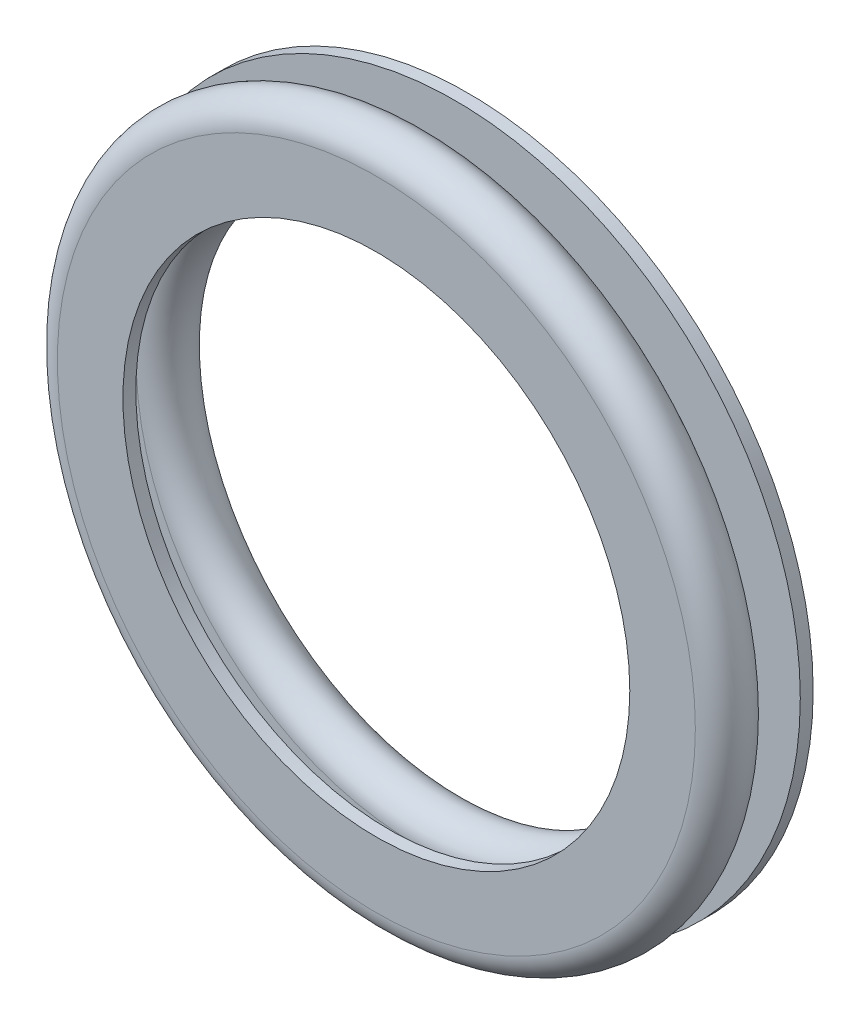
ISO-10303-21;
HEADER;
FILE_DESCRIPTION(('STEP AP214'),'2;1');
FILE_NAME('part.step','',(''),(''),'','','');
FILE_SCHEMA(('AUTOMOTIVE_DESIGN { 1 0 10303 214 1 1 1 1 }'));
ENDSEC;
DATA;
#1=APPLICATION_CONTEXT('core data for automotive mechanical design processes');
#2=APPLICATION_PROTOCOL_DEFINITION('international standard','automotive_design',2000,#1);
#3=PRODUCT_CONTEXT('',#1,'mechanical');
#4=PRODUCT('Part','Part','',(#3));
#5=PRODUCT_RELATED_PRODUCT_CATEGORY('part','',(#4));
#6=PRODUCT_DEFINITION_FORMATION('','',#4);
#7=PRODUCT_DEFINITION_CONTEXT('part definition',#1,'design');
#8=PRODUCT_DEFINITION('design','',#6,#7);
#9=PRODUCT_DEFINITION_SHAPE('','',#8);
#10=(LENGTH_UNIT() NAMED_UNIT(*) SI_UNIT(.MILLI.,.METRE.));
#11=(NAMED_UNIT(*) PLANE_ANGLE_UNIT() SI_UNIT($,.RADIAN.));
#12=(NAMED_UNIT(*) SI_UNIT($,.STERADIAN.) SOLID_ANGLE_UNIT());
#13=UNCERTAINTY_MEASURE_WITH_UNIT(LENGTH_MEASURE(1.E-05),#10,'distance_accuracy_value','');
#14=(GEOMETRIC_REPRESENTATION_CONTEXT(3) GLOBAL_UNCERTAINTY_ASSIGNED_CONTEXT((#13)) GLOBAL_UNIT_ASSIGNED_CONTEXT((#10,
#11,#12)) REPRESENTATION_CONTEXT('',''));
#15=CARTESIAN_POINT('',(0.,0.,0.));
#16=DIRECTION('',(0.,0.,1.));
#17=DIRECTION('',(1.,0.,0.));
#18=AXIS2_PLACEMENT_3D('',#15,#16,#17);
#19=CARTESIAN_POINT('',(0.,0.,0.));
#20=DIRECTION('',(0.,0.,1.));
#21=DIRECTION('',(1.,0.,0.));
#22=AXIS2_PLACEMENT_3D('',#19,#20,#21);
#23=CYLINDRICAL_SURFACE('',#22,4.92);
#24=CARTESIAN_POINT('',(0.,0.,-0.25));
#25=DIRECTION('',(0.,0.,1.));
#26=DIRECTION('',(1.,0.,0.));
#27=AXIS2_PLACEMENT_3D('',#24,#25,#26);
#28=CIRCLE('',#27,4.92);
#29=CARTESIAN_POINT('',(4.92,0.,-0.25));
#30=VERTEX_POINT('',#29);
#31=EDGE_CURVE('E54',#30,#30,#28,.T.);
#32=ORIENTED_EDGE('',*,*,#31,.F.);
#33=EDGE_LOOP('',(#32));
#34=FACE_BOUND('',#33,.T.);
#35=CARTESIAN_POINT('',(0.,0.,0.));
#36=DIRECTION('',(0.,0.,1.));
#37=DIRECTION('',(1.,0.,0.));
#38=AXIS2_PLACEMENT_3D('',#35,#36,#37);
#39=CIRCLE('',#38,4.92);
#40=CARTESIAN_POINT('',(4.92,0.,0.));
#41=VERTEX_POINT('',#40);
#42=EDGE_CURVE('E9',#41,#41,#39,.T.);
#43=ORIENTED_EDGE('',*,*,#42,.T.);
#44=EDGE_LOOP('',(#43));
#45=FACE_BOUND('',#44,.T.);
#46=ADVANCED_FACE('F14',(#34,#45),#23,.F.);
#47=CARTESIAN_POINT('',(0.,4.92,0.));
#48=DIRECTION('',(0.,0.,-1.));
#49=DIRECTION('',(-1.,0.,0.));
#50=AXIS2_PLACEMENT_3D('',#47,#48,#49);
#51=PLANE('',#50);
#52=ORIENTED_EDGE('',*,*,#42,.F.);
#53=EDGE_LOOP('',(#52));
#54=FACE_BOUND('',#53,.T.);
#55=CARTESIAN_POINT('',(0.,0.,0.));
#56=DIRECTION('',(0.,0.,1.));
#57=DIRECTION('',(1.,0.,0.));
#58=AXIS2_PLACEMENT_3D('',#55,#56,#57);
#59=CIRCLE('',#58,6.1925);
#60=CARTESIAN_POINT('',(6.1925,0.,0.));
#61=VERTEX_POINT('',#60);
#62=EDGE_CURVE('E20',#61,#61,#59,.T.);
#63=ORIENTED_EDGE('',*,*,#62,.T.);
#64=EDGE_LOOP('',(#63));
#65=FACE_BOUND('',#64,.T.);
#66=ADVANCED_FACE('F61',(#54,#65),#51,.F.);
#67=CARTESIAN_POINT('',(0.,0.,-0.507500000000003));
#68=DIRECTION('',(0.,0.,1.));
#69=DIRECTION('',(1.,0.,0.));
#70=AXIS2_PLACEMENT_3D('',#67,#68,#69);
#71=TOROIDAL_SURFACE('',#70,6.1925,0.507500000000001);
#72=ORIENTED_EDGE('',*,*,#62,.F.);
#73=EDGE_LOOP('',(#72));
#74=FACE_BOUND('',#73,.T.);
#75=CARTESIAN_POINT('',(0.,0.,-1.015));
#76=DIRECTION('',(0.,0.,1.));
#77=DIRECTION('',(1.,0.,0.));
#78=AXIS2_PLACEMENT_3D('',#75,#76,#77);
#79=CIRCLE('',#78,6.1925);
#80=CARTESIAN_POINT('',(6.1925,0.,-1.015));
#81=VERTEX_POINT('',#80);
#82=EDGE_CURVE('E24',#81,#81,#79,.T.);
#83=ORIENTED_EDGE('',*,*,#82,.T.);
#84=EDGE_LOOP('',(#83));
#85=FACE_BOUND('',#84,.T.);
#86=ADVANCED_FACE('F66',(#74,#85),#71,.T.);
#87=CARTESIAN_POINT('',(0.,6.1925,-1.015));
#88=DIRECTION('',(0.,0.,1.));
#89=DIRECTION('',(1.,0.,0.));
#90=AXIS2_PLACEMENT_3D('',#87,#88,#89);
#91=PLANE('',#90);
#92=ORIENTED_EDGE('',*,*,#82,.F.);
#93=EDGE_LOOP('',(#92));
#94=FACE_BOUND('',#93,.T.);
#95=CARTESIAN_POINT('',(0.,0.,-1.015));
#96=DIRECTION('',(0.,0.,1.));
#97=DIRECTION('',(1.,0.,0.));
#98=AXIS2_PLACEMENT_3D('',#95,#96,#97);
#99=CIRCLE('',#98,5.4275);
#100=CARTESIAN_POINT('',(5.4275,0.,-1.015));
#101=VERTEX_POINT('',#100);
#102=EDGE_CURVE('E28',#101,#101,#99,.T.);
#103=ORIENTED_EDGE('',*,*,#102,.T.);
#104=EDGE_LOOP('',(#103));
#105=FACE_BOUND('',#104,.T.);
#106=ADVANCED_FACE('F71',(#94,#105),#91,.F.);
#107=CARTESIAN_POINT('',(0.,0.,-1.2725));
#108=DIRECTION('',(0.,0.,1.));
#109=DIRECTION('',(1.,0.,0.));
#110=AXIS2_PLACEMENT_3D('',#107,#108,#109);
#111=TOROIDAL_SURFACE('',#110,5.4275,0.257499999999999);
#112=ORIENTED_EDGE('',*,*,#102,.F.);
#113=EDGE_LOOP('',(#112));
#114=FACE_BOUND('',#113,.T.);
#115=CARTESIAN_POINT('',(0.,0.,-1.53));
#116=DIRECTION('',(0.,0.,1.));
#117=DIRECTION('',(1.,0.,0.));
#118=AXIS2_PLACEMENT_3D('',#115,#116,#117);
#119=CIRCLE('',#118,5.4275);
#120=CARTESIAN_POINT('',(5.4275,0.,-1.53));
#121=VERTEX_POINT('',#120);
#122=EDGE_CURVE('E33',#121,#121,#119,.T.);
#123=ORIENTED_EDGE('',*,*,#122,.T.);
#124=EDGE_LOOP('',(#123));
#125=FACE_BOUND('',#124,.T.);
#126=ADVANCED_FACE('F77',(#114,#125),#111,.F.);
#127=CARTESIAN_POINT('',(0.,5.4275,-1.53));
#128=DIRECTION('',(0.,0.,-1.));
#129=DIRECTION('',(-1.,0.,0.));
#130=AXIS2_PLACEMENT_3D('',#127,#128,#129);
#131=PLANE('',#130);
#132=ORIENTED_EDGE('',*,*,#122,.F.);
#133=EDGE_LOOP('',(#132));
#134=FACE_BOUND('',#133,.T.);
#135=CARTESIAN_POINT('',(0.,0.,-1.53));
#136=DIRECTION('',(0.,0.,1.));
#137=DIRECTION('',(1.,0.,0.));
#138=AXIS2_PLACEMENT_3D('',#135,#136,#137);
#139=CIRCLE('',#138,6.7);
#140=CARTESIAN_POINT('',(6.7,0.,-1.53));
#141=VERTEX_POINT('',#140);
#142=EDGE_CURVE('E36',#141,#141,#139,.T.);
#143=ORIENTED_EDGE('',*,*,#142,.T.);
#144=EDGE_LOOP('',(#143));
#145=FACE_BOUND('',#144,.T.);
#146=ADVANCED_FACE('F81',(#134,#145),#131,.F.);
#147=CARTESIAN_POINT('',(0.,0.,0.));
#148=DIRECTION('',(0.,0.,1.));
#149=DIRECTION('',(1.,0.,0.));
#150=AXIS2_PLACEMENT_3D('',#147,#148,#149);
#151=CYLINDRICAL_SURFACE('',#150,6.7);
#152=ORIENTED_EDGE('',*,*,#142,.F.);
#153=EDGE_LOOP('',(#152));
#154=FACE_BOUND('',#153,.T.);
#155=CARTESIAN_POINT('',(0.,0.,-1.78));
#156=DIRECTION('',(0.,0.,1.));
#157=DIRECTION('',(1.,0.,0.));
#158=AXIS2_PLACEMENT_3D('',#155,#156,#157);
#159=CIRCLE('',#158,6.7);
#160=CARTESIAN_POINT('',(6.7,0.,-1.78));
#161=VERTEX_POINT('',#160);
#162=EDGE_CURVE('E39',#161,#161,#159,.T.);
#163=ORIENTED_EDGE('',*,*,#162,.T.);
#164=EDGE_LOOP('',(#163));
#165=FACE_BOUND('',#164,.T.);
#166=ADVANCED_FACE('F85',(#154,#165),#151,.T.);
#167=CARTESIAN_POINT('',(0.,5.4275,-1.78));
#168=DIRECTION('',(0.,0.,1.));
#169=DIRECTION('',(1.,0.,0.));
#170=AXIS2_PLACEMENT_3D('',#167,#168,#169);
#171=PLANE('',#170);
#172=ORIENTED_EDGE('',*,*,#162,.F.);
#173=EDGE_LOOP('',(#172));
#174=FACE_BOUND('',#173,.T.);
#175=CARTESIAN_POINT('',(0.,0.,-1.78));
#176=DIRECTION('',(0.,0.,1.));
#177=DIRECTION('',(1.,0.,0.));
#178=AXIS2_PLACEMENT_3D('',#175,#176,#177);
#179=CIRCLE('',#178,5.4275);
#180=CARTESIAN_POINT('',(5.4275,0.,-1.78));
#181=VERTEX_POINT('',#180);
#182=EDGE_CURVE('E42',#181,#181,#179,.T.);
#183=ORIENTED_EDGE('',*,*,#182,.T.);
#184=EDGE_LOOP('',(#183));
#185=FACE_BOUND('',#184,.T.);
#186=ADVANCED_FACE('F89',(#174,#185),#171,.F.);
#187=CARTESIAN_POINT('',(0.,0.,-1.2725));
#188=DIRECTION('',(0.,0.,1.));
#189=DIRECTION('',(1.,0.,0.));
#190=AXIS2_PLACEMENT_3D('',#187,#188,#189);
#191=TOROIDAL_SURFACE('',#190,5.4275,0.507500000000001);
#192=ORIENTED_EDGE('',*,*,#182,.F.);
#193=EDGE_LOOP('',(#192));
#194=FACE_BOUND('',#193,.T.);
#195=CARTESIAN_POINT('',(0.,0.,-0.765000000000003));
#196=DIRECTION('',(0.,0.,1.));
#197=DIRECTION('',(1.,0.,0.));
#198=AXIS2_PLACEMENT_3D('',#195,#196,#197);
#199=CIRCLE('',#198,5.4275);
#200=CARTESIAN_POINT('',(5.4275,0.,-0.765000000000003));
#201=VERTEX_POINT('',#200);
#202=EDGE_CURVE('E45',#201,#201,#199,.T.);
#203=ORIENTED_EDGE('',*,*,#202,.T.);
#204=EDGE_LOOP('',(#203));
#205=FACE_BOUND('',#204,.T.);
#206=ADVANCED_FACE('F93',(#194,#205),#191,.T.);
#207=CARTESIAN_POINT('',(0.,6.1925,-0.765000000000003));
#208=DIRECTION('',(0.,0.,-1.));
#209=DIRECTION('',(-1.,0.,0.));
#210=AXIS2_PLACEMENT_3D('',#207,#208,#209);
#211=PLANE('',#210);
#212=ORIENTED_EDGE('',*,*,#202,.F.);
#213=EDGE_LOOP('',(#212));
#214=FACE_BOUND('',#213,.T.);
#215=CARTESIAN_POINT('',(0.,0.,-0.765000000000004));
#216=DIRECTION('',(0.,0.,1.));
#217=DIRECTION('',(1.,0.,0.));
#218=AXIS2_PLACEMENT_3D('',#215,#216,#217);
#219=CIRCLE('',#218,6.1925);
#220=CARTESIAN_POINT('',(6.1925,0.,-0.765000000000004));
#221=VERTEX_POINT('',#220);
#222=EDGE_CURVE('E48',#221,#221,#219,.T.);
#223=ORIENTED_EDGE('',*,*,#222,.T.);
#224=EDGE_LOOP('',(#223));
#225=FACE_BOUND('',#224,.T.);
#226=ADVANCED_FACE('F97',(#214,#225),#211,.F.);
#227=CARTESIAN_POINT('',(0.,0.,-0.507500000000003));
#228=DIRECTION('',(0.,0.,1.));
#229=DIRECTION('',(1.,0.,0.));
#230=AXIS2_PLACEMENT_3D('',#227,#228,#229);
#231=TOROIDAL_SURFACE('',#230,6.1925,0.257500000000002);
#232=ORIENTED_EDGE('',*,*,#222,.F.);
#233=EDGE_LOOP('',(#232));
#234=FACE_BOUND('',#233,.T.);
#235=CARTESIAN_POINT('',(0.,0.,-0.250000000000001));
#236=DIRECTION('',(0.,0.,1.));
#237=DIRECTION('',(1.,0.,0.));
#238=AXIS2_PLACEMENT_3D('',#235,#236,#237);
#239=CIRCLE('',#238,6.1925);
#240=CARTESIAN_POINT('',(6.1925,0.,-0.250000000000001));
#241=VERTEX_POINT('',#240);
#242=EDGE_CURVE('E51',#241,#241,#239,.T.);
#243=ORIENTED_EDGE('',*,*,#242,.T.);
#244=EDGE_LOOP('',(#243));
#245=FACE_BOUND('',#244,.T.);
#246=ADVANCED_FACE('F101',(#234,#245),#231,.F.);
#247=CARTESIAN_POINT('',(0.,4.92,-0.250000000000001));
#248=DIRECTION('',(0.,0.,1.));
#249=DIRECTION('',(1.,0.,0.));
#250=AXIS2_PLACEMENT_3D('',#247,#248,#249);
#251=PLANE('',#250);
#252=ORIENTED_EDGE('',*,*,#242,.F.);
#253=EDGE_LOOP('',(#252));
#254=FACE_BOUND('',#253,.T.);
#255=ORIENTED_EDGE('',*,*,#31,.T.);
#256=EDGE_LOOP('',(#255));
#257=FACE_BOUND('',#256,.T.);
#258=ADVANCED_FACE('F58',(#254,#257),#251,.F.);
#259=CLOSED_SHELL('',(#46,#66,#86,#106,#126,#146,#166,#186,#206,#226,#246,#258));
#260=MANIFOLD_SOLID_BREP('B1',#259);
#261=ADVANCED_BREP_SHAPE_REPRESENTATION('',(#18,#260),#14);
#262=SHAPE_DEFINITION_REPRESENTATION(#9,#261);
ENDSEC;
END-ISO-10303-21;
